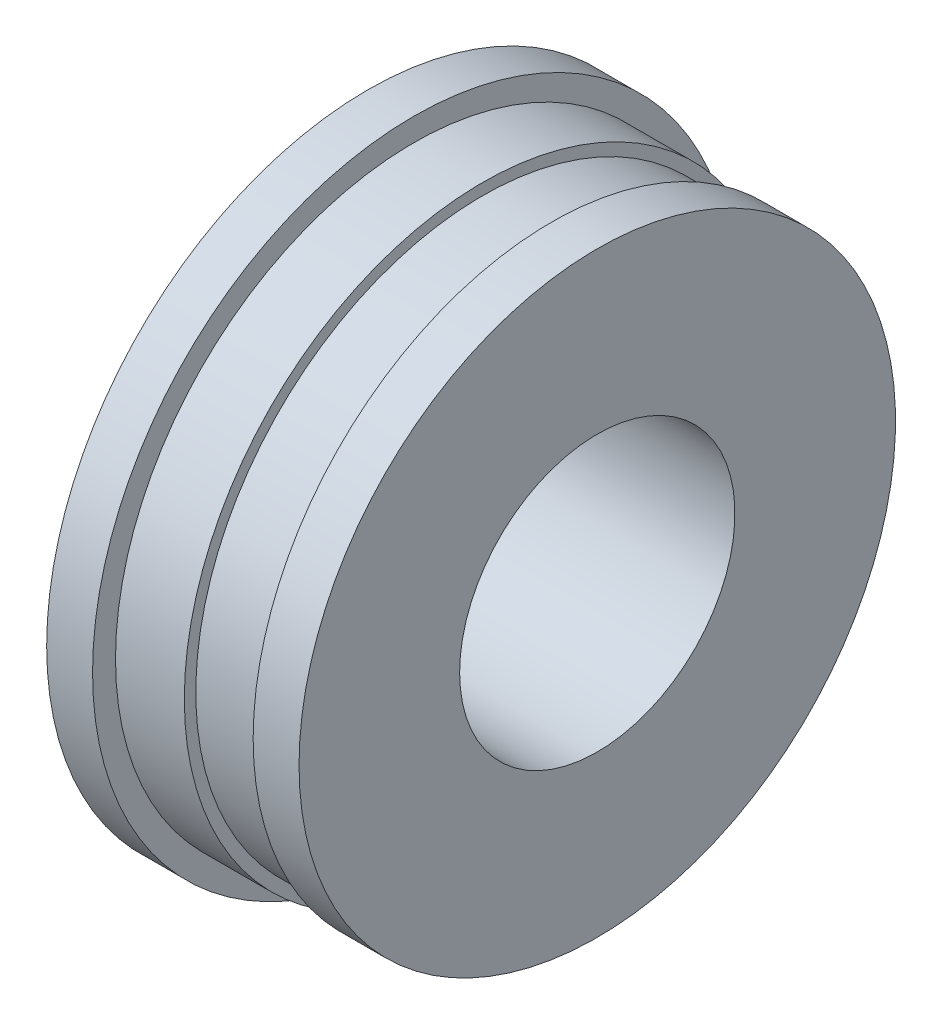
from build123d import *

# Parameters (mm, degrees)
ESQUISSE2_W = 3
ESQUISSE2_H = 6.449043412


with BuildPart() as part:
    # Esquisse1 → R_volution1 (revolve)
    with BuildSketch(Plane.XY, mode=Mode.PRIVATE) as r_volution1_sk:
        Polygon((0, 6), (0, 14), (2, 14), (2, 13), (10, 13), (10, 6), align=None)
    revolve(r_volution1_sk.sketch.rotate(Axis((0, 0, 0), (1, 0, 0)), 90), axis=Axis((0, 0, 0), (1, 0, 0)))

    # Esquisse2 → Enl_vement de mati_re-R_volution1 (revolve, cut)
    with BuildSketch(Plane.XY, mode=Mode.PRIVATE) as enl_vement_de_mati_re_r_volution1_sk:
        with Locations((6.5, 15.724521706)):
            Rectangle(ESQUISSE2_W, ESQUISSE2_H)
    revolve(enl_vement_de_mati_re_r_volution1_sk.sketch.rotate(Axis((49.542664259, 0, 0), (-1, 0, 0)), 270), axis=Axis((49.542664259, 0, 0), (-1, 0, 0)), mode=Mode.SUBTRACT)


solid = part.part
